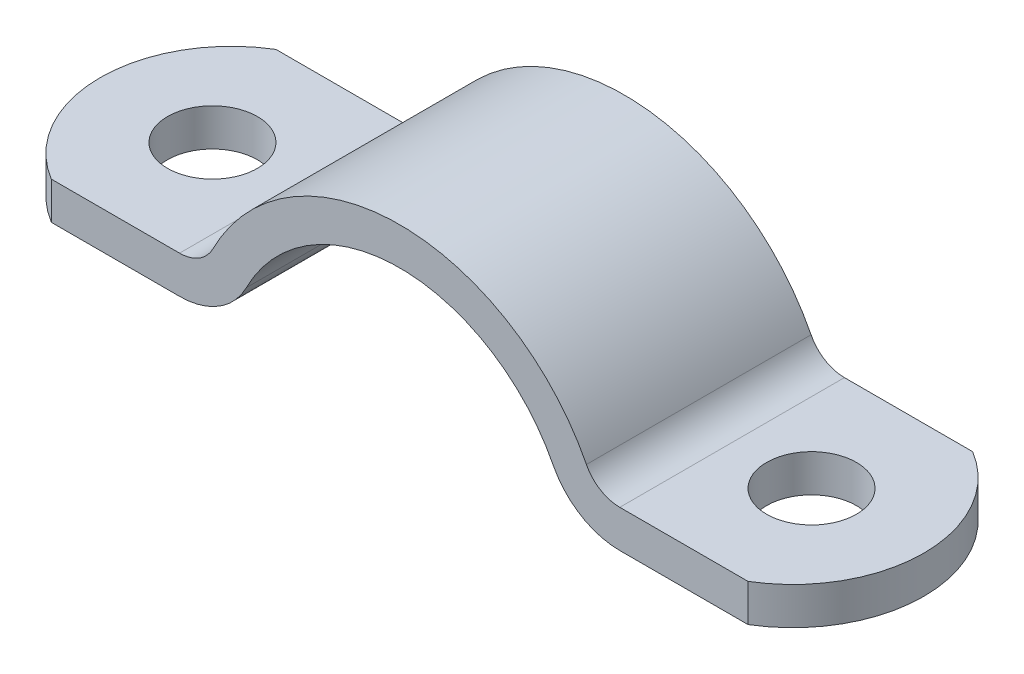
ISO-10303-21;
HEADER;
FILE_DESCRIPTION(('STEP AP214'),'2;1');
FILE_NAME('part.step','',(''),(''),'','','');
FILE_SCHEMA(('AUTOMOTIVE_DESIGN { 1 0 10303 214 1 1 1 1 }'));
ENDSEC;
DATA;
#1=APPLICATION_CONTEXT('core data for automotive mechanical design processes');
#2=APPLICATION_PROTOCOL_DEFINITION('international standard','automotive_design',2000,#1);
#3=PRODUCT_CONTEXT('',#1,'mechanical');
#4=PRODUCT('Part','Part','',(#3));
#5=PRODUCT_RELATED_PRODUCT_CATEGORY('part','',(#4));
#6=PRODUCT_DEFINITION_FORMATION('','',#4);
#7=PRODUCT_DEFINITION_CONTEXT('part definition',#1,'design');
#8=PRODUCT_DEFINITION('design','',#6,#7);
#9=PRODUCT_DEFINITION_SHAPE('','',#8);
#10=(LENGTH_UNIT() NAMED_UNIT(*) SI_UNIT(.MILLI.,.METRE.));
#11=(NAMED_UNIT(*) PLANE_ANGLE_UNIT() SI_UNIT($,.RADIAN.));
#12=(NAMED_UNIT(*) SI_UNIT($,.STERADIAN.) SOLID_ANGLE_UNIT());
#13=UNCERTAINTY_MEASURE_WITH_UNIT(LENGTH_MEASURE(1.E-05),#10,'distance_accuracy_value','');
#14=(GEOMETRIC_REPRESENTATION_CONTEXT(3) GLOBAL_UNCERTAINTY_ASSIGNED_CONTEXT((#13)) GLOBAL_UNIT_ASSIGNED_CONTEXT((#10,
#11,#12)) REPRESENTATION_CONTEXT('',''));
#15=CARTESIAN_POINT('',(0.,0.,0.));
#16=DIRECTION('',(0.,0.,1.));
#17=DIRECTION('',(1.,0.,0.));
#18=AXIS2_PLACEMENT_3D('',#15,#16,#17);
#19=CARTESIAN_POINT('',(0.,-5.,15.));
#20=DIRECTION('',(0.,0.,1.));
#21=DIRECTION('',(1.,0.,0.));
#22=AXIS2_PLACEMENT_3D('',#19,#20,#21);
#23=PLANE('',#22);
#24=DIRECTION('',(1.,0.,0.));
#25=VECTOR('',#24,1.);
#26=CARTESIAN_POINT('',(22.4499443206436,0.,15.));
#27=LINE('',#26,#25);
#28=CARTESIAN_POINT('',(29.3938769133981,0.,15.));
#29=VERTEX_POINT('',#28);
#30=CARTESIAN_POINT('',(46.51387818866,0.,15.));
#31=VERTEX_POINT('',#30);
#32=EDGE_CURVE('E218',#29,#31,#27,.T.);
#33=ORIENTED_EDGE('',*,*,#32,.T.);
#34=DIRECTION('',(0.,-1.,0.));
#35=VECTOR('',#34,1.);
#36=CARTESIAN_POINT('',(46.51387818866,23.,15.));
#37=LINE('',#36,#35);
#38=CARTESIAN_POINT('',(46.51387818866,5.,15.));
#39=VERTEX_POINT('',#38);
#40=EDGE_CURVE('E122',#39,#31,#37,.T.);
#41=ORIENTED_EDGE('',*,*,#40,.F.);
#42=DIRECTION('',(-1.,0.,0.));
#43=VECTOR('',#42,1.);
#44=CARTESIAN_POINT('',(60.,5.,15.));
#45=LINE('',#44,#43);
#46=CARTESIAN_POINT('',(29.3938769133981,5.,15.));
#47=VERTEX_POINT('',#46);
#48=EDGE_CURVE('E220',#39,#47,#45,.T.);
#49=ORIENTED_EDGE('',*,*,#48,.T.);
#50=CARTESIAN_POINT('',(29.3938769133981,9.99999999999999,15.));
#51=DIRECTION('',(0.,0.,1.));
#52=DIRECTION('',(1.,0.,0.));
#53=AXIS2_PLACEMENT_3D('',#50,#51,#52);
#54=CIRCLE('',#53,5.);
#55=CARTESIAN_POINT('',(24.9402591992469,7.72727272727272,15.));
#56=VERTEX_POINT('',#55);
#57=EDGE_CURVE('E189',#47,#56,#54,.F.);
#58=ORIENTED_EDGE('',*,*,#57,.T.);
#59=CARTESIAN_POINT('',(0.,-5.,15.));
#60=DIRECTION('',(0.,0.,1.));
#61=DIRECTION('',(1.,0.,0.));
#62=AXIS2_PLACEMENT_3D('',#59,#60,#61);
#63=CIRCLE('',#62,28.);
#64=CARTESIAN_POINT('',(-24.9402591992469,7.72727272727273,15.));
#65=VERTEX_POINT('',#64);
#66=EDGE_CURVE('E226',#56,#65,#63,.T.);
#67=ORIENTED_EDGE('',*,*,#66,.T.);
#68=CARTESIAN_POINT('',(-29.3938769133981,9.99999999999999,15.));
#69=DIRECTION('',(0.,0.,1.));
#70=DIRECTION('',(1.,0.,0.));
#71=AXIS2_PLACEMENT_3D('',#68,#69,#70);
#72=CIRCLE('',#71,5.);
#73=CARTESIAN_POINT('',(-29.3938769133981,5.,15.));
#74=VERTEX_POINT('',#73);
#75=EDGE_CURVE('E193',#65,#74,#72,.F.);
#76=ORIENTED_EDGE('',*,*,#75,.T.);
#77=DIRECTION('',(-1.,0.,0.));
#78=VECTOR('',#77,1.);
#79=CARTESIAN_POINT('',(-60.,4.99999999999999,15.));
#80=LINE('',#79,#78);
#81=CARTESIAN_POINT('',(-46.51387818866,4.99999999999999,15.));
#82=VERTEX_POINT('',#81);
#83=EDGE_CURVE('E229',#74,#82,#80,.T.);
#84=ORIENTED_EDGE('',*,*,#83,.T.);
#85=DIRECTION('',(0.,-1.,0.));
#86=VECTOR('',#85,1.);
#87=CARTESIAN_POINT('',(-46.51387818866,23.,15.));
#88=LINE('',#87,#86);
#89=CARTESIAN_POINT('',(-46.51387818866,0.,15.));
#90=VERTEX_POINT('',#89);
#91=EDGE_CURVE('E203',#82,#90,#88,.T.);
#92=ORIENTED_EDGE('',*,*,#91,.T.);
#93=DIRECTION('',(1.,0.,0.));
#94=VECTOR('',#93,1.);
#95=CARTESIAN_POINT('',(-22.4499443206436,0.,15.));
#96=LINE('',#95,#94);
#97=CARTESIAN_POINT('',(-29.3938769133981,0.,15.));
#98=VERTEX_POINT('',#97);
#99=EDGE_CURVE('E159',#90,#98,#96,.T.);
#100=ORIENTED_EDGE('',*,*,#99,.T.);
#101=CARTESIAN_POINT('',(-29.3938769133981,10.,15.));
#102=DIRECTION('',(0.,0.,1.));
#103=DIRECTION('',(1.,0.,0.));
#104=AXIS2_PLACEMENT_3D('',#101,#102,#103);
#105=CIRCLE('',#104,10.);
#106=CARTESIAN_POINT('',(-20.4866414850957,5.45454545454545,15.));
#107=VERTEX_POINT('',#106);
#108=EDGE_CURVE('E169',#98,#107,#105,.T.);
#109=ORIENTED_EDGE('',*,*,#108,.T.);
#110=CARTESIAN_POINT('',(0.,-5.,15.));
#111=DIRECTION('',(0.,0.,-1.));
#112=DIRECTION('',(1.,0.,0.));
#113=AXIS2_PLACEMENT_3D('',#110,#111,#112);
#114=CIRCLE('',#113,23.);
#115=CARTESIAN_POINT('',(20.4866414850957,5.45454545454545,15.));
#116=VERTEX_POINT('',#115);
#117=EDGE_CURVE('E156',#107,#116,#114,.T.);
#118=ORIENTED_EDGE('',*,*,#117,.T.);
#119=CARTESIAN_POINT('',(29.3938769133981,10.,15.));
#120=DIRECTION('',(0.,0.,1.));
#121=DIRECTION('',(1.,0.,0.));
#122=AXIS2_PLACEMENT_3D('',#119,#120,#121);
#123=CIRCLE('',#122,10.);
#124=EDGE_CURVE('E171',#116,#29,#123,.T.);
#125=ORIENTED_EDGE('',*,*,#124,.T.);
#126=EDGE_LOOP('',(#33,#41,#49,#58,#67,#76,#84,#92,#100,#109,#118,#125));
#127=FACE_BOUND('',#126,.T.);
#128=ADVANCED_FACE('F33',(#127),#23,.T.);
#129=CARTESIAN_POINT('',(0.,-5.,-15.));
#130=DIRECTION('',(0.,0.,1.));
#131=DIRECTION('',(1.,0.,0.));
#132=AXIS2_PLACEMENT_3D('',#129,#130,#131);
#133=PLANE('',#132);
#134=DIRECTION('',(0.,-1.,0.));
#135=VECTOR('',#134,1.);
#136=CARTESIAN_POINT('',(46.51387818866,23.,-15.));
#137=LINE('',#136,#135);
#138=CARTESIAN_POINT('',(46.51387818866,5.,-15.));
#139=VERTEX_POINT('',#138);
#140=CARTESIAN_POINT('',(46.51387818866,0.,-15.));
#141=VERTEX_POINT('',#140);
#142=EDGE_CURVE('E47',#139,#141,#137,.T.);
#143=ORIENTED_EDGE('',*,*,#142,.T.);
#144=DIRECTION('',(1.,0.,0.));
#145=VECTOR('',#144,1.);
#146=CARTESIAN_POINT('',(22.4499443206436,0.,-15.));
#147=LINE('',#146,#145);
#148=CARTESIAN_POINT('',(29.3938769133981,0.,-15.));
#149=VERTEX_POINT('',#148);
#150=EDGE_CURVE('E133',#149,#141,#147,.T.);
#151=ORIENTED_EDGE('',*,*,#150,.F.);
#152=CARTESIAN_POINT('',(29.3938769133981,10.,-15.));
#153=DIRECTION('',(0.,0.,1.));
#154=DIRECTION('',(1.,0.,0.));
#155=AXIS2_PLACEMENT_3D('',#152,#153,#154);
#156=CIRCLE('',#155,10.);
#157=CARTESIAN_POINT('',(20.4866414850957,5.45454545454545,-15.));
#158=VERTEX_POINT('',#157);
#159=EDGE_CURVE('E162',#149,#158,#156,.F.);
#160=ORIENTED_EDGE('',*,*,#159,.T.);
#161=CARTESIAN_POINT('',(0.,-5.,-15.));
#162=DIRECTION('',(0.,0.,-1.));
#163=DIRECTION('',(1.,0.,0.));
#164=AXIS2_PLACEMENT_3D('',#161,#162,#163);
#165=CIRCLE('',#164,23.);
#166=CARTESIAN_POINT('',(-20.4866414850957,5.45454545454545,-15.));
#167=VERTEX_POINT('',#166);
#168=EDGE_CURVE('E141',#167,#158,#165,.T.);
#169=ORIENTED_EDGE('',*,*,#168,.F.);
#170=CARTESIAN_POINT('',(-29.3938769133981,10.,-15.));
#171=DIRECTION('',(0.,0.,1.));
#172=DIRECTION('',(1.,0.,0.));
#173=AXIS2_PLACEMENT_3D('',#170,#171,#172);
#174=CIRCLE('',#173,10.);
#175=CARTESIAN_POINT('',(-29.3938769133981,0.,-15.));
#176=VERTEX_POINT('',#175);
#177=EDGE_CURVE('E158',#167,#176,#174,.F.);
#178=ORIENTED_EDGE('',*,*,#177,.T.);
#179=DIRECTION('',(1.,0.,0.));
#180=VECTOR('',#179,1.);
#181=CARTESIAN_POINT('',(-22.4499443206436,0.,-15.));
#182=LINE('',#181,#180);
#183=CARTESIAN_POINT('',(-46.51387818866,0.,-15.));
#184=VERTEX_POINT('',#183);
#185=EDGE_CURVE('E154',#184,#176,#182,.T.);
#186=ORIENTED_EDGE('',*,*,#185,.F.);
#187=DIRECTION('',(0.,-1.,0.));
#188=VECTOR('',#187,1.);
#189=CARTESIAN_POINT('',(-46.51387818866,23.,-15.));
#190=LINE('',#189,#188);
#191=CARTESIAN_POINT('',(-46.51387818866,4.99999999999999,-15.));
#192=VERTEX_POINT('',#191);
#193=EDGE_CURVE('E41',#192,#184,#190,.T.);
#194=ORIENTED_EDGE('',*,*,#193,.F.);
#195=DIRECTION('',(-1.,0.,0.));
#196=VECTOR('',#195,1.);
#197=CARTESIAN_POINT('',(-60.,4.99999999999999,-15.));
#198=LINE('',#197,#196);
#199=CARTESIAN_POINT('',(-29.3938769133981,5.,-15.));
#200=VERTEX_POINT('',#199);
#201=EDGE_CURVE('E151',#200,#192,#198,.T.);
#202=ORIENTED_EDGE('',*,*,#201,.F.);
#203=CARTESIAN_POINT('',(-29.3938769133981,9.99999999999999,-15.));
#204=DIRECTION('',(0.,0.,1.));
#205=DIRECTION('',(1.,0.,0.));
#206=AXIS2_PLACEMENT_3D('',#203,#204,#205);
#207=CIRCLE('',#206,5.);
#208=CARTESIAN_POINT('',(-24.9402591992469,7.72727272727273,-15.));
#209=VERTEX_POINT('',#208);
#210=EDGE_CURVE('E191',#200,#209,#207,.T.);
#211=ORIENTED_EDGE('',*,*,#210,.T.);
#212=CARTESIAN_POINT('',(0.,-5.,-15.));
#213=DIRECTION('',(0.,0.,1.));
#214=DIRECTION('',(1.,0.,0.));
#215=AXIS2_PLACEMENT_3D('',#212,#213,#214);
#216=CIRCLE('',#215,28.);
#217=CARTESIAN_POINT('',(24.9402591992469,7.72727272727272,-15.));
#218=VERTEX_POINT('',#217);
#219=EDGE_CURVE('E143',#218,#209,#216,.T.);
#220=ORIENTED_EDGE('',*,*,#219,.F.);
#221=CARTESIAN_POINT('',(29.3938769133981,9.99999999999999,-15.));
#222=DIRECTION('',(0.,0.,1.));
#223=DIRECTION('',(1.,0.,0.));
#224=AXIS2_PLACEMENT_3D('',#221,#222,#223);
#225=CIRCLE('',#224,5.);
#226=CARTESIAN_POINT('',(29.3938769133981,5.,-15.));
#227=VERTEX_POINT('',#226);
#228=EDGE_CURVE('E187',#218,#227,#225,.T.);
#229=ORIENTED_EDGE('',*,*,#228,.T.);
#230=DIRECTION('',(-1.,0.,0.));
#231=VECTOR('',#230,1.);
#232=CARTESIAN_POINT('',(60.,5.,-15.));
#233=LINE('',#232,#231);
#234=EDGE_CURVE('E135',#139,#227,#233,.T.);
#235=ORIENTED_EDGE('',*,*,#234,.F.);
#236=EDGE_LOOP('',(#143,#151,#160,#169,#178,#186,#194,#202,#211,#220,#229,#235));
#237=FACE_BOUND('',#236,.T.);
#238=ADVANCED_FACE('F132',(#237),#133,.F.);
#239=CARTESIAN_POINT('',(22.4499443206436,0.,15.));
#240=DIRECTION('',(0.,1.,0.));
#241=DIRECTION('',(0.,0.,1.));
#242=AXIS2_PLACEMENT_3D('',#239,#240,#241);
#243=PLANE('',#242);
#244=CARTESIAN_POINT('',(40.,0.,0.));
#245=DIRECTION('',(0.,1.,0.));
#246=DIRECTION('',(-1.,0.,0.));
#247=AXIS2_PLACEMENT_3D('',#244,#245,#246);
#248=CIRCLE('',#247,5.99999999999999);
#249=CARTESIAN_POINT('',(34.,0.,0.));
#250=VERTEX_POINT('',#249);
#251=EDGE_CURVE('E255',#250,#250,#248,.T.);
#252=ORIENTED_EDGE('',*,*,#251,.T.);
#253=EDGE_LOOP('',(#252));
#254=FACE_BOUND('',#253,.T.);
#255=CARTESIAN_POINT('',(37.5,0.,0.));
#256=DIRECTION('',(0.,-1.,0.));
#257=DIRECTION('',(0.,0.,-1.));
#258=AXIS2_PLACEMENT_3D('',#255,#256,#257);
#259=CIRCLE('',#258,17.5);
#260=EDGE_CURVE('E119',#141,#31,#259,.T.);
#261=ORIENTED_EDGE('',*,*,#260,.T.);
#262=ORIENTED_EDGE('',*,*,#32,.F.);
#263=DIRECTION('',(0.,0.,-1.));
#264=VECTOR('',#263,1.);
#265=CARTESIAN_POINT('',(29.3938769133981,0.,15.));
#266=LINE('',#265,#264);
#267=EDGE_CURVE('E140',#29,#149,#266,.T.);
#268=ORIENTED_EDGE('',*,*,#267,.T.);
#269=ORIENTED_EDGE('',*,*,#150,.T.);
#270=EDGE_LOOP('',(#261,#262,#268,#269));
#271=FACE_BOUND('',#270,.T.);
#272=ADVANCED_FACE('F138',(#254,#271),#243,.F.);
#273=CARTESIAN_POINT('',(60.,5.,15.));
#274=DIRECTION('',(0.,-1.,0.));
#275=DIRECTION('',(1.,0.,0.));
#276=AXIS2_PLACEMENT_3D('',#273,#274,#275);
#277=PLANE('',#276);
#278=CARTESIAN_POINT('',(40.,5.00000000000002,0.));
#279=DIRECTION('',(0.,1.,0.));
#280=DIRECTION('',(-1.,0.,0.));
#281=AXIS2_PLACEMENT_3D('',#278,#279,#280);
#282=CIRCLE('',#281,5.99999999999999);
#283=CARTESIAN_POINT('',(34.,5.00000000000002,0.));
#284=VERTEX_POINT('',#283);
#285=EDGE_CURVE('E258',#284,#284,#282,.T.);
#286=ORIENTED_EDGE('',*,*,#285,.F.);
#287=EDGE_LOOP('',(#286));
#288=FACE_BOUND('',#287,.T.);
#289=CARTESIAN_POINT('',(37.5,5.,0.));
#290=DIRECTION('',(0.,-1.,0.));
#291=DIRECTION('',(1.,0.,0.));
#292=AXIS2_PLACEMENT_3D('',#289,#290,#291);
#293=CIRCLE('',#292,17.5);
#294=EDGE_CURVE('E11',#139,#39,#293,.T.);
#295=ORIENTED_EDGE('',*,*,#294,.F.);
#296=ORIENTED_EDGE('',*,*,#234,.T.);
#297=DIRECTION('',(0.,0.,1.));
#298=VECTOR('',#297,1.);
#299=CARTESIAN_POINT('',(29.3938769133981,5.,15.));
#300=LINE('',#299,#298);
#301=EDGE_CURVE('E181',#227,#47,#300,.T.);
#302=ORIENTED_EDGE('',*,*,#301,.T.);
#303=ORIENTED_EDGE('',*,*,#48,.F.);
#304=EDGE_LOOP('',(#295,#296,#302,#303));
#305=FACE_BOUND('',#304,.T.);
#306=ADVANCED_FACE('F249',(#288,#305),#277,.F.);
#307=CARTESIAN_POINT('',(-60.,4.99999999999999,15.));
#308=DIRECTION('',(0.,-1.,0.));
#309=DIRECTION('',(1.,0.,0.));
#310=AXIS2_PLACEMENT_3D('',#307,#308,#309);
#311=PLANE('',#310);
#312=CARTESIAN_POINT('',(-40.,4.99999999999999,0.));
#313=DIRECTION('',(0.,1.,0.));
#314=DIRECTION('',(-1.,0.,0.));
#315=AXIS2_PLACEMENT_3D('',#312,#313,#314);
#316=CIRCLE('',#315,5.99999999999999);
#317=CARTESIAN_POINT('',(-46.,4.99999999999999,0.));
#318=VERTEX_POINT('',#317);
#319=EDGE_CURVE('E252',#318,#318,#316,.T.);
#320=ORIENTED_EDGE('',*,*,#319,.F.);
#321=EDGE_LOOP('',(#320));
#322=FACE_BOUND('',#321,.T.);
#323=CARTESIAN_POINT('',(-37.5,4.99999999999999,0.));
#324=DIRECTION('',(0.,-1.,0.));
#325=DIRECTION('',(1.,0.,0.));
#326=AXIS2_PLACEMENT_3D('',#323,#324,#325);
#327=CIRCLE('',#326,17.5);
#328=EDGE_CURVE('E55',#82,#192,#327,.T.);
#329=ORIENTED_EDGE('',*,*,#328,.F.);
#330=ORIENTED_EDGE('',*,*,#83,.F.);
#331=DIRECTION('',(0.,0.,1.));
#332=VECTOR('',#331,1.);
#333=CARTESIAN_POINT('',(-29.3938769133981,5.,-15.));
#334=LINE('',#333,#332);
#335=EDGE_CURVE('E184',#74,#200,#334,.F.);
#336=ORIENTED_EDGE('',*,*,#335,.T.);
#337=ORIENTED_EDGE('',*,*,#201,.T.);
#338=EDGE_LOOP('',(#329,#330,#336,#337));
#339=FACE_BOUND('',#338,.T.);
#340=ADVANCED_FACE('F235',(#322,#339),#311,.F.);
#341=CARTESIAN_POINT('',(-22.4499443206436,0.,15.));
#342=DIRECTION('',(0.,1.,0.));
#343=DIRECTION('',(-1.,0.,0.));
#344=AXIS2_PLACEMENT_3D('',#341,#342,#343);
#345=PLANE('',#344);
#346=CARTESIAN_POINT('',(-40.,0.,0.));
#347=DIRECTION('',(0.,1.,0.));
#348=DIRECTION('',(-1.,0.,0.));
#349=AXIS2_PLACEMENT_3D('',#346,#347,#348);
#350=CIRCLE('',#349,5.99999999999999);
#351=CARTESIAN_POINT('',(-46.,0.,0.));
#352=VERTEX_POINT('',#351);
#353=EDGE_CURVE('E127',#352,#352,#350,.T.);
#354=ORIENTED_EDGE('',*,*,#353,.T.);
#355=EDGE_LOOP('',(#354));
#356=FACE_BOUND('',#355,.T.);
#357=CARTESIAN_POINT('',(-37.5,0.,0.));
#358=DIRECTION('',(0.,-1.,0.));
#359=DIRECTION('',(0.,0.,-1.));
#360=AXIS2_PLACEMENT_3D('',#357,#358,#359);
#361=CIRCLE('',#360,17.5);
#362=EDGE_CURVE('E196',#90,#184,#361,.T.);
#363=ORIENTED_EDGE('',*,*,#362,.T.);
#364=ORIENTED_EDGE('',*,*,#185,.T.);
#365=DIRECTION('',(0.,0.,-1.));
#366=VECTOR('',#365,1.);
#367=CARTESIAN_POINT('',(-29.3938769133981,0.,15.));
#368=LINE('',#367,#366);
#369=EDGE_CURVE('E173',#176,#98,#368,.F.);
#370=ORIENTED_EDGE('',*,*,#369,.T.);
#371=ORIENTED_EDGE('',*,*,#99,.F.);
#372=EDGE_LOOP('',(#363,#364,#370,#371));
#373=FACE_BOUND('',#372,.T.);
#374=ADVANCED_FACE('F202',(#356,#373),#345,.F.);
#375=CARTESIAN_POINT('',(0.,-5.,15.));
#376=DIRECTION('',(0.,0.,-1.));
#377=DIRECTION('',(-1.,0.,0.));
#378=AXIS2_PLACEMENT_3D('',#375,#376,#377);
#379=CYLINDRICAL_SURFACE('',#378,23.);
#380=ORIENTED_EDGE('',*,*,#168,.T.);
#381=DIRECTION('',(0.,0.,-1.));
#382=VECTOR('',#381,1.);
#383=CARTESIAN_POINT('',(20.4866414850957,5.45454545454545,15.));
#384=LINE('',#383,#382);
#385=EDGE_CURVE('E167',#158,#116,#384,.F.);
#386=ORIENTED_EDGE('',*,*,#385,.T.);
#387=ORIENTED_EDGE('',*,*,#117,.F.);
#388=DIRECTION('',(0.,0.,-1.));
#389=VECTOR('',#388,1.);
#390=CARTESIAN_POINT('',(-20.4866414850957,5.45454545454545,15.));
#391=LINE('',#390,#389);
#392=EDGE_CURVE('E164',#107,#167,#391,.T.);
#393=ORIENTED_EDGE('',*,*,#392,.T.);
#394=EDGE_LOOP('',(#380,#386,#387,#393));
#395=FACE_BOUND('',#394,.T.);
#396=ADVANCED_FACE('F216',(#395),#379,.F.);
#397=CARTESIAN_POINT('',(0.,-5.,15.));
#398=DIRECTION('',(0.,0.,-1.));
#399=DIRECTION('',(-1.,0.,0.));
#400=AXIS2_PLACEMENT_3D('',#397,#398,#399);
#401=CYLINDRICAL_SURFACE('',#400,28.);
#402=ORIENTED_EDGE('',*,*,#66,.F.);
#403=DIRECTION('',(0.,0.,-1.));
#404=VECTOR('',#403,1.);
#405=CARTESIAN_POINT('',(24.9402591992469,7.72727272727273,15.));
#406=LINE('',#405,#404);
#407=EDGE_CURVE('E178',#56,#218,#406,.T.);
#408=ORIENTED_EDGE('',*,*,#407,.T.);
#409=ORIENTED_EDGE('',*,*,#219,.T.);
#410=DIRECTION('',(0.,0.,-1.));
#411=VECTOR('',#410,1.);
#412=CARTESIAN_POINT('',(-24.9402591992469,7.72727272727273,15.));
#413=LINE('',#412,#411);
#414=EDGE_CURVE('E176',#209,#65,#413,.F.);
#415=ORIENTED_EDGE('',*,*,#414,.T.);
#416=EDGE_LOOP('',(#402,#408,#409,#415));
#417=FACE_BOUND('',#416,.T.);
#418=ADVANCED_FACE('F241',(#417),#401,.T.);
#419=CARTESIAN_POINT('',(29.3938769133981,10.,15.));
#420=DIRECTION('',(0.,0.,-1.));
#421=DIRECTION('',(-1.,0.,0.));
#422=AXIS2_PLACEMENT_3D('',#419,#420,#421);
#423=CYLINDRICAL_SURFACE('',#422,10.);
#424=ORIENTED_EDGE('',*,*,#124,.F.);
#425=ORIENTED_EDGE('',*,*,#385,.F.);
#426=ORIENTED_EDGE('',*,*,#159,.F.);
#427=ORIENTED_EDGE('',*,*,#267,.F.);
#428=EDGE_LOOP('',(#424,#425,#426,#427));
#429=FACE_BOUND('',#428,.T.);
#430=ADVANCED_FACE('F294',(#429),#423,.T.);
#431=CARTESIAN_POINT('',(-29.3938769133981,10.,15.));
#432=DIRECTION('',(0.,0.,-1.));
#433=DIRECTION('',(-1.,0.,0.));
#434=AXIS2_PLACEMENT_3D('',#431,#432,#433);
#435=CYLINDRICAL_SURFACE('',#434,10.);
#436=ORIENTED_EDGE('',*,*,#108,.F.);
#437=ORIENTED_EDGE('',*,*,#369,.F.);
#438=ORIENTED_EDGE('',*,*,#177,.F.);
#439=ORIENTED_EDGE('',*,*,#392,.F.);
#440=EDGE_LOOP('',(#436,#437,#438,#439));
#441=FACE_BOUND('',#440,.T.);
#442=ADVANCED_FACE('F210',(#441),#435,.T.);
#443=CARTESIAN_POINT('',(29.3938769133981,9.99999999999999,15.));
#444=DIRECTION('',(0.,0.,-1.));
#445=DIRECTION('',(-1.,0.,0.));
#446=AXIS2_PLACEMENT_3D('',#443,#444,#445);
#447=CYLINDRICAL_SURFACE('',#446,5.);
#448=ORIENTED_EDGE('',*,*,#57,.F.);
#449=ORIENTED_EDGE('',*,*,#301,.F.);
#450=ORIENTED_EDGE('',*,*,#228,.F.);
#451=ORIENTED_EDGE('',*,*,#407,.F.);
#452=EDGE_LOOP('',(#448,#449,#450,#451));
#453=FACE_BOUND('',#452,.T.);
#454=ADVANCED_FACE('F245',(#453),#447,.F.);
#455=CARTESIAN_POINT('',(-29.3938769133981,9.99999999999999,15.));
#456=DIRECTION('',(0.,0.,-1.));
#457=DIRECTION('',(-1.,0.,0.));
#458=AXIS2_PLACEMENT_3D('',#455,#456,#457);
#459=CYLINDRICAL_SURFACE('',#458,5.);
#460=ORIENTED_EDGE('',*,*,#75,.F.);
#461=ORIENTED_EDGE('',*,*,#414,.F.);
#462=ORIENTED_EDGE('',*,*,#210,.F.);
#463=ORIENTED_EDGE('',*,*,#335,.F.);
#464=EDGE_LOOP('',(#460,#461,#462,#463));
#465=FACE_BOUND('',#464,.T.);
#466=ADVANCED_FACE('F35',(#465),#459,.F.);
#467=CARTESIAN_POINT('',(-37.5,23.,0.));
#468=DIRECTION('',(0.,-1.,0.));
#469=DIRECTION('',(0.,0.,-1.));
#470=AXIS2_PLACEMENT_3D('',#467,#468,#469);
#471=CYLINDRICAL_SURFACE('',#470,17.5);
#472=ORIENTED_EDGE('',*,*,#328,.T.);
#473=ORIENTED_EDGE('',*,*,#193,.T.);
#474=ORIENTED_EDGE('',*,*,#362,.F.);
#475=ORIENTED_EDGE('',*,*,#91,.F.);
#476=EDGE_LOOP('',(#472,#473,#474,#475));
#477=FACE_BOUND('',#476,.T.);
#478=ADVANCED_FACE('F195',(#477),#471,.T.);
#479=CARTESIAN_POINT('',(37.5,23.,0.));
#480=DIRECTION('',(0.,-1.,0.));
#481=DIRECTION('',(0.,0.,-1.));
#482=AXIS2_PLACEMENT_3D('',#479,#480,#481);
#483=CYLINDRICAL_SURFACE('',#482,17.5);
#484=ORIENTED_EDGE('',*,*,#294,.T.);
#485=ORIENTED_EDGE('',*,*,#40,.T.);
#486=ORIENTED_EDGE('',*,*,#260,.F.);
#487=ORIENTED_EDGE('',*,*,#142,.F.);
#488=EDGE_LOOP('',(#484,#485,#486,#487));
#489=FACE_BOUND('',#488,.T.);
#490=ADVANCED_FACE('F120',(#489),#483,.T.);
#491=CARTESIAN_POINT('',(-40.,0.,0.));
#492=DIRECTION('',(0.,1.,0.));
#493=DIRECTION('',(-1.,0.,0.));
#494=AXIS2_PLACEMENT_3D('',#491,#492,#493);
#495=CYLINDRICAL_SURFACE('',#494,5.99999999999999);
#496=ORIENTED_EDGE('',*,*,#353,.F.);
#497=EDGE_LOOP('',(#496));
#498=FACE_BOUND('',#497,.T.);
#499=ORIENTED_EDGE('',*,*,#319,.T.);
#500=EDGE_LOOP('',(#499));
#501=FACE_BOUND('',#500,.T.);
#502=ADVANCED_FACE('F268',(#498,#501),#495,.F.);
#503=CARTESIAN_POINT('',(40.,0.,0.));
#504=DIRECTION('',(0.,1.,0.));
#505=DIRECTION('',(-1.,0.,0.));
#506=AXIS2_PLACEMENT_3D('',#503,#504,#505);
#507=CYLINDRICAL_SURFACE('',#506,5.99999999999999);
#508=ORIENTED_EDGE('',*,*,#251,.F.);
#509=EDGE_LOOP('',(#508));
#510=FACE_BOUND('',#509,.T.);
#511=ORIENTED_EDGE('',*,*,#285,.T.);
#512=EDGE_LOOP('',(#511));
#513=FACE_BOUND('',#512,.T.);
#514=ADVANCED_FACE('F265',(#510,#513),#507,.F.);
#515=CLOSED_SHELL('',(#128,#238,#272,#306,#340,#374,#396,#418,#430,#442,#454,#466,#478,#490,
#502,#514));
#516=MANIFOLD_SOLID_BREP('B2',#515);
#517=ADVANCED_BREP_SHAPE_REPRESENTATION('',(#18,#516),#14);
#518=SHAPE_DEFINITION_REPRESENTATION(#9,#517);
ENDSEC;
END-ISO-10303-21;
